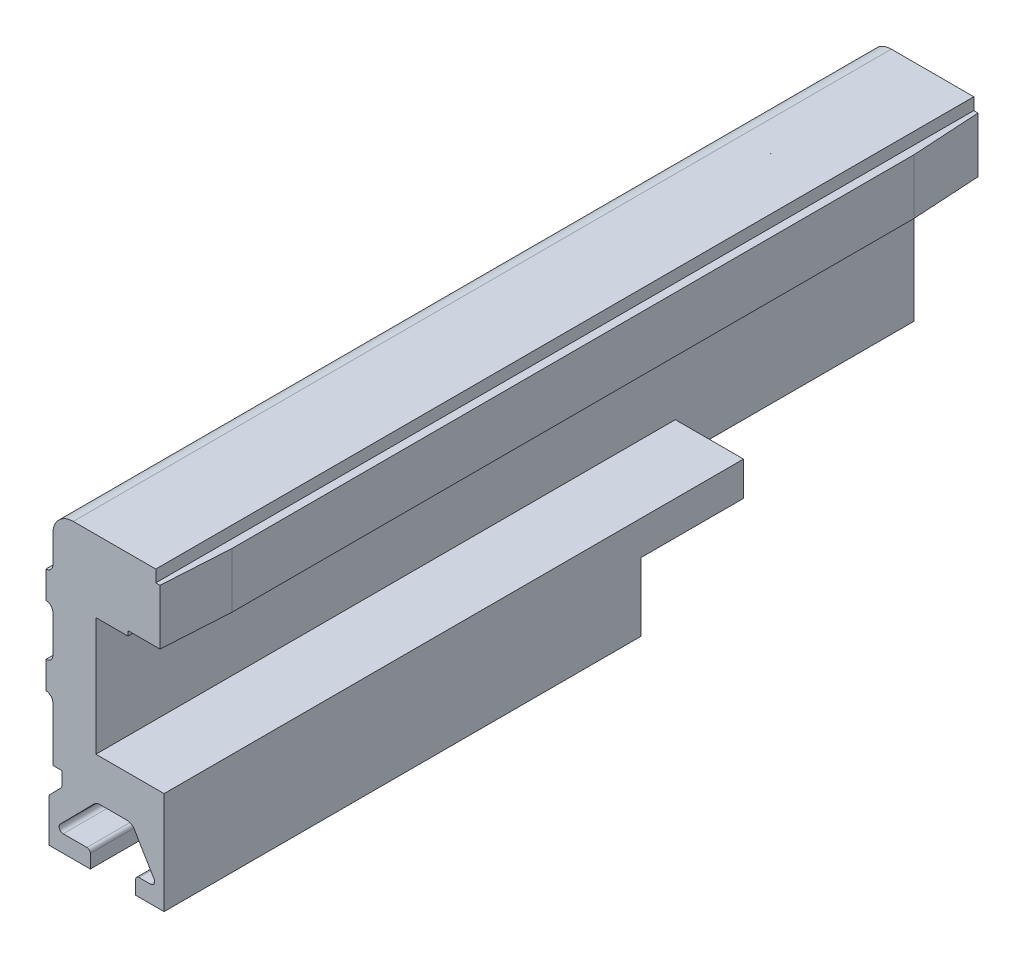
from build123d import *

# Parameters (mm, degrees)
EXTRUDE1_DEPTH     = 152.4
SKETCH2_W          = 63.5
SKETCH2_H          = 12.7
CUT_EXTRUDE1_DEPTH = 164.342499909
SKETCH3_W          = 44.45
SKETCH3_H          = 6.35
CUT_EXTRUDE2_DEPTH = 12.7
SKETCH4_R          = 2.413
CUT_EXTRUDE3_DEPTH = 163.352134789
CUT_EXTRUDE4_REACH = 164.539
SKETCH12_W         = 0.790251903
SKETCH12_H         = 0.684884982
SKETCH12_H_2       = 3.002957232
EXTRUDE3_DEPTH     = 0.127


with BuildPart() as part:
    # Sketch1 → Extrude1 (new body)
    with BuildSketch(Plane.XY):
        with BuildLine():
            Line((19.91614, 54.5084), (4.546619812, 54.5084))
            ThreePointArc((4.546619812, 54.5084), (1.852528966, 53.392471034), (0.7366, 50.698380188))
            Line((0.7366, 50.698380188), (0.7366, 45.567713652))
            ThreePointArc((0.7366, 45.567713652), (0.364632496, 44.669647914), (-0.5334, 44.297600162))
            Line((-0.5334, 44.297600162), (-0.5334, 39.217600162))
            ThreePointArc((-0.5334, 39.217600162), (0.358682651, 38.85157562), (0.7366, 37.964465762))
            Line((0.7366, 37.964465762), (0.7366, 30.988190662))
            ThreePointArc((0.7366, 30.988190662), (0.36459237, 30.090084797), (-0.533513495, 29.718077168))
            Line((-0.533513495, 29.718077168), (-0.533513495, 24.638077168))
            ThreePointArc((-0.533513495, 24.638077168), (0.36459237, 24.266069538), (0.7366, 23.367963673))
            Line((0.7366, 23.367963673), (0.7366, 13.235253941))
            Line((0.7366, 13.235253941), (2.413, 13.235253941))
            Line((2.413, 13.235253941), (2.413, 10.822253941))
            ThreePointArc((2.413, 10.822253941), (2.355993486, 10.533068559), (2.193503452, 10.287152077))
            Line((2.193503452, 10.287152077), (0.219496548, 8.28584049))
            ThreePointArc((0.219496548, 8.28584049), (0.057006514, 8.039924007), (0, 7.750738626))
            Line((0, 7.750738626), (0, 0))
            Line((0, 0), (7.7216, 0))
            Line((7.7216, 0), (7.7216, 2.54))
            ThreePointArc((7.7216, 2.54), (7.535612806, 2.989012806), (7.0866, 3.175))
            Line((7.0866, 3.175), (2.667, 3.175))
            ThreePointArc((2.667, 3.175), (1.964009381, 3.642979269), (2.124496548, 4.472101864))
            Line((2.124496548, 4.472101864), (8.414593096, 10.849203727))
            ThreePointArc((8.414593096, 10.849203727), (8.911558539, 11.184981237), (9.4996, 11.303))
            Line((9.4996, 11.303), (14.5796, 11.303))
            ThreePointArc((14.5796, 11.303), (15.332434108, 11.104072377), (15.88873344, 10.559221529))
            Line((15.88873344, 10.559221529), (19.60296672, 4.327110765))
            ThreePointArc((19.60296672, 4.327110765), (19.610936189, 3.560582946), (18.9484, 3.175))
            Line((18.9484, 3.175), (16.7894, 3.175))
            ThreePointArc((16.7894, 3.175), (16.340387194, 2.989012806), (16.1544, 2.54))
            Line((16.1544, 2.54), (16.1544, 0))
            Line((16.1544, 0), (21.463, 0))
            Line((21.463, 0), (21.463, 19.05))
            Line((21.463, 19.05), (8.763, 19.05))
            Line((8.763, 19.05), (8.763, 41.0972))
            Line((8.763, 41.0972), (14.732, 41.0972))
            Line((14.732, 41.0972), (14.732, 41.9862))
            Line((14.732, 41.9862), (21.463, 41.9862))
            Line((21.463, 41.9862), (21.463, 52.2732))
            Line((21.463, 52.2732), (19.91614, 52.2732))
            Line((19.91614, 52.2732), (19.91614, 54.5084))
        make_face()
    extrude(amount=EXTRUDE1_DEPTH)

    # Sketch2 → Cut-Extrude1 (cut, through all)
    with BuildSketch(Plane(origin=(21.463, 0, 0), x_dir=(0, 0, -1), z_dir=(1, 0, 0))):
        with Locations((-31.75, 6.35)):
            Rectangle(SKETCH2_W, SKETCH2_H)
    extrude(amount=-CUT_EXTRUDE1_DEPTH, mode=Mode.SUBTRACT)

    # Sketch3 → Cut-Extrude2 (cut)
    with BuildSketch(Plane(origin=(21.463, 0, 0), x_dir=(0, 0, -1), z_dir=(1, 0, 0))):
        with Locations((-22.225, 15.875)):
            Rectangle(SKETCH3_W, SKETCH3_H)
    extrude(amount=-CUT_EXTRUDE2_DEPTH, mode=Mode.SUBTRACT)

    # Sketch4 → Cut-Extrude3 (cut, through all)
    with BuildSketch(Plane(origin=(8.763, 0, 0), x_dir=(0, 0, -1), z_dir=(1, 0, 0))):
        with Locations((-12.7, 31.8008)):
            Circle(SKETCH4_R)
    extrude(amount=-CUT_EXTRUDE3_DEPTH, mode=Mode.SUBTRACT)

    # Sketch6 → Cut-Extrude4 (cut, up to next)
    with BuildSketch(Plane(origin=(0, 52.2732, 0), x_dir=(-1, 0, 0), z_dir=(0, 1, 0)), mode=Mode.PRIVATE) as cut_extrude4_sk1:
        Polygon((-21.463, 152.4), (-21.463, 139.7), (-20.701, 152.4), align=None)
    cut_extrude4_tool1 = extrude(cut_extrude4_sk1.sketch, amount=-CUT_EXTRUDE4_REACH, mode=Mode.PRIVATE) & part.part
    # Sketch6 → Cut-Extrude4 (cut, up to next)
    with BuildSketch(Plane(origin=(0, 52.2732, 0), x_dir=(-1, 0, 0), z_dir=(0, 1, 0)), mode=Mode.PRIVATE) as cut_extrude4_sk2:
        Polygon((-21.463, 0), (-21.463, 12.7), (-20.701, 0), align=None)
    cut_extrude4_tool2 = extrude(cut_extrude4_sk2.sketch, amount=-CUT_EXTRUDE4_REACH, mode=Mode.PRIVATE) & part.part
    add(cut_extrude4_tool1.solids().sort_by_distance((21.209, 52.2732, 148.166667))[0], mode=Mode.SUBTRACT)
    add(cut_extrude4_tool2.solids().sort_by_distance((21.209, 52.2732, 4.233333))[0], mode=Mode.SUBTRACT)

    # Sketch12 → Extrude3 (add)
    # profile 1 of 10: a face of its own
    with BuildSketch(Plane.ZY.offset(-0.7366)):
        with BuildLine():
            add(Edge.make_bspline(
                [(29.063970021, 33.066190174), (29.114779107, 33.031363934), (29.216594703, 32.961576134), (29.378541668, 32.871296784), (29.545636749, 32.789223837), (29.661763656, 32.745079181), (29.720043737, 32.722924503)],
                knots=[0, 0, 0, 0, 0.994855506, 1.99357661, 2.993045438, 4, 4, 4, 4], degree=3))
            Line((29.720043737, 32.722924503), (29.41793702, 32.143406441))
            add(Edge.make_bspline(
                [(29.41793702, 32.143406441), (29.356174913, 32.162524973), (29.231668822, 32.201065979), (29.114141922, 32.257418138), (29.054915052, 32.285816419)],
                knots=[0, 0, 0, 0, 0.992113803, 2, 2, 2, 2], degree=3))
            add(Edge.make_bspline(
                [(29.054915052, 32.285816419), (29.04910316, 32.288748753), (29.032272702, 32.297240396), (29.001702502, 32.318144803), (28.955059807, 32.346320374), (28.894343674, 32.385347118), (28.818943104, 32.433720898), (28.728614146, 32.491389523), (28.624602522, 32.559983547), (28.549801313, 32.60829556), (28.50997051, 32.634021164)],
                knots=[0, 0, 0, 0, 0.241377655, 0.698997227, 1.371388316, 2.263975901, 3.376788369, 4.695767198, 6.240533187, 8, 8, 8, 8], degree=3))
            add(Edge.make_bspline(
                [(28.50997051, 32.634021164), (28.476937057, 32.619874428), (28.410550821, 32.591444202), (28.307549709, 32.556436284), (28.20192934, 32.526945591), (28.094064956, 32.501935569), (27.983500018, 32.483352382), (27.87039083, 32.469101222), (27.754420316, 32.460743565), (27.676103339, 32.459921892), (27.636577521, 32.459507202)],
                knots=[0, 0, 0, 0, 0.961025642, 1.931341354, 2.907359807, 3.893838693, 4.891829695, 5.905170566, 6.942759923, 8, 8, 8, 8], degree=3))
            add(Edge.make_bspline(
                [(27.636577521, 32.459507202), (27.561602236, 32.461332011), (27.41504694, 32.464898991), (27.201350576, 32.490179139), (27.000556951, 32.533996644), (26.811784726, 32.593847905), (26.636168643, 32.672417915), (26.472168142, 32.76739109), (26.322053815, 32.881231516), (26.183757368, 33.010450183), (26.061404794, 33.156501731), (25.954293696, 33.316836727), (25.863556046, 33.490923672), (25.790390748, 33.679679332), (25.732566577, 33.881577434), (25.693142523, 34.09804325), (25.667768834, 34.327792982), (25.664892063, 34.485829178), (25.663417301, 34.56684561)],
                knots=[0, 0, 0, 0, 1.098101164, 2.146474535, 3.146072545, 4.104420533, 5.041773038, 5.958565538, 6.874115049, 7.795336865, 8.725215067, 9.658214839, 10.614563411, 11.594512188, 12.618591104, 13.685899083, 14.813688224, 16, 16, 16, 16], degree=3))
            add(Edge.make_bspline(
                [(25.663417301, 34.56684561), (25.664895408, 34.647858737), (25.667768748, 34.805342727), (25.692969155, 35.034649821), (25.733707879, 35.25034225), (25.790942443, 35.452561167), (25.865203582, 35.640775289), (25.956295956, 35.814879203), (26.06357545, 35.975552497), (26.187378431, 36.121282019), (26.324941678, 36.251823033), (26.475492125, 36.364817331), (26.637279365, 36.461292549), (26.810946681, 36.539788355), (26.99697349, 36.599606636), (27.193943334, 36.643284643), (27.402946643, 36.668873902), (27.545956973, 36.672384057), (27.619290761, 36.674184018)],
                knots=[0, 0, 0, 0, 1.193283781, 2.319662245, 3.393996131, 4.424093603, 5.411284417, 6.369670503, 7.313761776, 8.251713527, 9.181123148, 10.102053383, 11.01932051, 11.951118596, 12.903560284, 13.893239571, 14.919681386, 16, 16, 16, 16], degree=3))
            add(Edge.make_bspline(
                [(27.619290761, 36.674184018), (27.69209783, 36.67286055), (27.834101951, 36.670279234), (28.041163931, 36.642671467), (28.236819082, 36.600783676), (28.421300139, 36.540402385), (28.593661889, 36.461986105), (28.754801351, 36.366778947), (28.903778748, 36.253976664), (29.040636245, 36.124681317), (29.1630414, 35.979454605), (29.271475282, 35.820685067), (29.360501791, 35.646415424), (29.435501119, 35.459602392), (29.491409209, 35.258423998), (29.532680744, 35.044033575), (29.557531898, 34.815755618), (29.560481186, 34.658829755), (29.561993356, 34.578370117)],
                knots=[0, 0, 0, 0, 1.078752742, 2.104017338, 3.091035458, 4.041673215, 4.975566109, 5.892967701, 6.810684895, 7.740128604, 8.678185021, 9.621404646, 10.583875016, 11.573429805, 12.6009998, 13.674031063, 14.80742018, 16, 16, 16, 16], degree=3))
            add(Edge.make_bspline(
                [(29.561993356, 34.578370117), (29.560362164, 34.493501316), (29.557191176, 34.328518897), (29.52959421, 34.08892719), (29.484858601, 33.864544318), (29.438770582, 33.723539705), (29.416290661, 33.654763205)],
                knots=[0, 0, 0, 0, 1.083667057, 2.106616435, 3.076482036, 4, 4, 4, 4], degree=3))
            add(Edge.make_bspline(
                [(29.416290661, 33.654763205), (29.396139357, 33.604103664), (29.355145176, 33.501045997), (29.274114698, 33.352288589), (29.177704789, 33.205527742), (29.102419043, 33.113294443), (29.063970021, 33.066190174)],
                knots=[0, 0, 0, 0, 0.948216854, 1.928975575, 2.942311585, 4, 4, 4, 4], degree=3))
        make_face()
        with BuildLine():
            add(Edge.make_bspline(
                [(28.40460359, 33.489304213), (28.434315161, 33.521786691), (28.493809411, 33.586829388), (28.567379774, 33.698235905), (28.631612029, 33.817706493), (28.682112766, 33.948221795), (28.722728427, 34.087794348), (28.751074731, 34.237461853), (28.768679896, 34.396848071), (28.770702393, 34.506431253), (28.771741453, 34.562729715)],
                knots=[0, 0, 0, 0, 0.906820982, 1.815812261, 2.745108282, 3.70056618, 4.696560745, 5.740060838, 6.83895416, 8, 8, 8, 8], degree=3))
            add(Edge.make_bspline(
                [(28.771741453, 34.562729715), (28.770830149, 34.620655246), (28.769064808, 34.732866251), (28.754442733, 34.895812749), (28.728711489, 35.04727694), (28.695129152, 35.187890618), (28.6493738, 35.316515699), (28.594193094, 35.434121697), (28.529500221, 35.54099798), (28.453705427, 35.635381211), (28.370338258, 35.718357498), (28.281219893, 35.791658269), (28.185048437, 35.853015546), (28.082313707, 35.902373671), (27.97387542, 35.941211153), (27.859476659, 35.969406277), (27.738859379, 35.985905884), (27.656384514, 35.988153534), (27.614351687, 35.989299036)],
                knots=[0, 0, 0, 0, 1.335693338, 2.587451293, 3.768164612, 4.876224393, 5.916940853, 6.910477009, 7.867661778, 8.790666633, 9.694493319, 10.576027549, 11.446684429, 12.318352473, 13.199023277, 14.098364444, 15.030842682, 16, 16, 16, 16], degree=3))
            add(Edge.make_bspline(
                [(27.614351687, 35.989299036), (27.57203745, 35.988190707), (27.489274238, 35.986022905), (27.368538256, 35.969123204), (27.253878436, 35.942286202), (27.145575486, 35.90314192), (27.0426503, 35.85369016), (26.946119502, 35.792446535), (26.855996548, 35.720296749), (26.772209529, 35.637844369), (26.697375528, 35.543431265), (26.630854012, 35.438415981), (26.575861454, 35.321589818), (26.53170051, 35.193608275), (26.496408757, 35.05512905), (26.470994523, 34.905409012), (26.456353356, 34.744673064), (26.454581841, 34.633828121), (26.453669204, 34.576723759)],
                knots=[0, 0, 0, 0, 0.980107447, 1.917010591, 2.819119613, 3.703969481, 4.579773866, 5.459928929, 6.346604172, 7.250235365, 8.177620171, 9.131899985, 10.124404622, 11.161948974, 12.264485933, 13.431998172, 14.677033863, 16, 16, 16, 16], degree=3))
            add(Edge.make_bspline(
                [(26.453669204, 34.576723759), (26.45455938, 34.518793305), (26.456287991, 34.406299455), (26.471247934, 34.24319346), (26.49550075, 34.091227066), (26.530025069, 33.950463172), (26.57416582, 33.820740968), (26.628535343, 33.702241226), (26.692845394, 33.59511213), (26.767302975, 33.500325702), (26.849213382, 33.416936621), (26.93673814, 33.344239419), (27.029166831, 33.281964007), (27.126930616, 33.231365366), (27.230055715, 33.192507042), (27.338182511, 33.164462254), (27.451940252, 33.147746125), (27.529508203, 33.145525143), (27.569076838, 33.144392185)],
                knots=[0, 0, 0, 0, 1.356840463, 2.634818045, 3.833173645, 4.958776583, 6.025986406, 7.038359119, 8.007356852, 8.946032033, 9.855123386, 10.740685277, 11.607120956, 12.460971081, 13.313368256, 14.183325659, 15.073285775, 16, 16, 16, 16], degree=3))
            add(Edge.make_bspline(
                [(27.569076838, 33.144392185), (27.598751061, 33.144912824), (27.65720311, 33.145938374), (27.743559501, 33.157466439), (27.827679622, 33.174131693), (27.882011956, 33.191100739), (27.909049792, 33.199545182)],
                knots=[0, 0, 0, 0, 1.028828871, 2.026578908, 3.017950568, 4, 4, 4, 4], degree=3))
            add(Edge.make_bspline(
                [(27.909049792, 33.199545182), (27.867597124, 33.221204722), (27.785510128, 33.264096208), (27.658599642, 33.31874778), (27.531435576, 33.367987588), (27.444948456, 33.394590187), (27.401971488, 33.407809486)],
                knots=[0, 0, 0, 0, 1.021704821, 2.023239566, 3.017713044, 4, 4, 4, 4], degree=3))
            Line((27.401971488, 33.407809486), (27.631638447, 33.881960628))
            add(Edge.make_bspline(
                [(27.631638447, 33.881960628), (27.698801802, 33.858750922), (27.833776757, 33.812107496), (28.028754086, 33.71948968), (28.221014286, 33.614077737), (28.342946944, 33.531208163), (28.40460359, 33.489304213)],
                knots=[0, 0, 0, 0, 0.979271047, 1.967993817, 2.972492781, 4, 4, 4, 4], degree=3))
        make_face(mode=Mode.SUBTRACT)
    # profile 2 of 10: a face of its own
    with BuildSketch(Plane.ZY.offset(-0.7366)):
        with BuildLine():
            Line((32.090799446, 32.512190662), (32.090799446, 32.954237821))
            add(Edge.make_bspline(
                [(32.090799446, 32.954237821), (32.064635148, 32.916402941), (32.012715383, 32.841324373), (31.917301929, 32.742940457), (31.810454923, 32.657572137), (31.69291904, 32.586424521), (31.568303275, 32.529678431), (31.438694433, 32.48893492), (31.305589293, 32.4644596), (31.215585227, 32.461160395), (31.17048525, 32.459507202)],
                knots=[0, 0, 0, 0, 1.012300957, 2.008784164, 3.006972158, 4.019128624, 5.028517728, 6.017265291, 7.006475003, 8, 8, 8, 8], degree=3))
            add(Edge.make_bspline(
                [(31.17048525, 32.459507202), (31.124820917, 32.461018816), (31.035266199, 32.46398332), (30.904779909, 32.489397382), (30.781606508, 32.530935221), (30.666358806, 32.588052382), (30.56288907, 32.661158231), (30.472811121, 32.747717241), (30.400016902, 32.849075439), (30.351666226, 32.943320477), (30.321324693, 33.026180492), (30.301926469, 33.094821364), (30.284340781, 33.169164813), (30.270847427, 33.249215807), (30.259900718, 33.334884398), (30.253022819, 33.426111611), (30.247681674, 33.52326687), (30.247151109, 33.589998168), (30.246878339, 33.62430558)],
                knots=[0, 0, 0, 0, 1.289498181, 2.528902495, 3.740215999, 4.953909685, 6.150063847, 7.307074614, 8.467199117, 9.660131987, 10.288158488, 10.958106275, 11.674712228, 12.445953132, 13.25095176, 14.114470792, 15.030625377, 16, 16, 16, 16], degree=3))
            Line((30.246878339, 33.62430558), (30.246878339, 35.515147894))
            Line((30.246878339, 35.515147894), (31.037130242, 35.515147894))
            Line((31.037130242, 35.515147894), (31.037130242, 34.129737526))
            add(Edge.make_bspline(
                [(31.037130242, 34.129737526), (31.037361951, 34.079249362), (31.037801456, 33.983483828), (31.039080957, 33.847365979), (31.042591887, 33.726910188), (31.046342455, 33.621776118), (31.051903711, 33.531999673), (31.059114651, 33.457584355), (31.067164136, 33.398522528), (31.078169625, 33.340944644), (31.100765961, 33.283156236), (31.131890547, 33.221080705), (31.174438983, 33.167795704), (31.223659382, 33.121516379), (31.281015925, 33.083167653), (31.347176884, 33.058952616), (31.419224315, 33.040877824), (31.469993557, 33.039660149), (31.49646416, 33.039025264)],
                knots=[0, 0, 0, 0, 1.799930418, 3.414093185, 4.852592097, 6.095879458, 7.164323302, 8.058836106, 8.760219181, 9.289718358, 10.143846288, 10.96209893, 11.756558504, 12.559405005, 13.365225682, 14.195378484, 15.059087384, 16, 16, 16, 16], degree=3))
            add(Edge.make_bspline(
                [(31.49646416, 33.039025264), (31.527028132, 33.040548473), (31.587214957, 33.043547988), (31.675178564, 33.064451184), (31.757328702, 33.10075345), (31.833930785, 33.149042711), (31.900995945, 33.208829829), (31.959232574, 33.275235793), (32.004596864, 33.349031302), (32.033523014, 33.417808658), (32.050857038, 33.482948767), (32.060367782, 33.54760204), (32.070802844, 33.626544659), (32.0771835, 33.720855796), (32.084358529, 33.830012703), (32.087822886, 33.954383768), (32.090429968, 34.093779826), (32.090671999, 34.19174843), (32.090799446, 34.243336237)],
                knots=[0, 0, 0, 0, 0.960139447, 1.890714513, 2.821289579, 3.770841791, 4.723832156, 5.63466777, 6.536687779, 7.433335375, 7.968708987, 8.650470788, 9.484586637, 10.470508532, 11.619255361, 12.921832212, 14.379114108, 16, 16, 16, 16], degree=3))
            Line((32.090799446, 34.243336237), (32.090799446, 35.515147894))
            Line((32.090799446, 35.515147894), (32.881051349, 35.515147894))
            Line((32.881051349, 35.515147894), (32.881051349, 32.512190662))
            Line((32.881051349, 32.512190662), (32.090799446, 32.512190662))
        make_face()
    # profile 3 of 10: a face of its own
    with BuildSketch(Plane.ZY.offset(-0.7366)):
        with Locations((34.119112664, 36.279058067)):
            Rectangle(SKETCH12_W, SKETCH12_H)
    # profile 4 of 10: a face of its own
    with BuildSketch(Plane.ZY.offset(-0.7366)):
        with Locations((34.119112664, 34.013669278)):
            Rectangle(SKETCH12_W, SKETCH12_H_2)
    # profile 5 of 10: a face of its own
    with BuildSketch(Plane.ZY.offset(-0.7366)):
        with BuildLine():
            Line((37.780613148, 34.61952907), (36.990361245, 34.51416215))
            add(Edge.make_bspline(
                [(36.990361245, 34.51416215), (36.98309805, 34.551169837), (36.96924159, 34.621771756), (36.934108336, 34.719543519), (36.886057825, 34.802644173), (36.825966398, 34.870538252), (36.755234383, 34.9234458), (36.674894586, 34.962027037), (36.584086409, 34.984469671), (36.52045328, 34.986999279), (36.487398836, 34.988313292)],
                knots=[0, 0, 0, 0, 1.183520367, 2.2578771, 3.246797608, 4.180863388, 5.085846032, 6.003342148, 6.962829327, 8, 8, 8, 8], degree=3))
            add(Edge.make_bspline(
                [(36.487398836, 34.988313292), (36.464867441, 34.987694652), (36.420948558, 34.986488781), (36.356706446, 34.976660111), (36.296526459, 34.958841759), (36.238870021, 34.936163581), (36.185632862, 34.905273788), (36.135237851, 34.868762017), (36.089263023, 34.82461107), (36.046163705, 34.774148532), (36.006535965, 34.715952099), (35.974423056, 34.647844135), (35.946265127, 34.571565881), (35.923380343, 34.486124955), (35.905736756, 34.391702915), (35.892457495, 34.288385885), (35.88536163, 34.17621105), (35.884470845, 34.098466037), (35.88400858, 34.058120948)],
                knots=[0, 0, 0, 0, 0.862078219, 1.680389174, 2.478024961, 3.259954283, 4.04533088, 4.826625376, 5.636266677, 6.477958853, 7.363321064, 8.321359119, 9.351280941, 10.472100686, 11.701575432, 13.024867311, 14.456081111, 16, 16, 16, 16], degree=3))
            add(Edge.make_bspline(
                [(35.88400858, 34.058120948), (35.884363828, 34.013379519), (35.885048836, 33.927106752), (35.893581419, 33.802682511), (35.90629728, 33.688605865), (35.924215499, 33.584563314), (35.94775579, 33.490921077), (35.976621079, 33.407191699), (36.00964371, 33.333093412), (36.050163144, 33.270026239), (36.093581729, 33.214849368), (36.142472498, 33.168819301), (36.192954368, 33.127446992), (36.249061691, 33.095814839), (36.307454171, 33.069381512), (36.370415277, 33.052945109), (36.436130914, 33.040296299), (36.481570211, 33.039453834), (36.504685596, 33.039025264)],
                knots=[0, 0, 0, 0, 1.594318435, 3.074248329, 4.44256617, 5.683784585, 6.834147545, 7.879495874, 8.83778105, 9.716843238, 10.544636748, 11.333080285, 12.105903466, 12.864046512, 13.621684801, 14.38335177, 15.177596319, 16, 16, 16, 16], degree=3))
            add(Edge.make_bspline(
                [(36.504685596, 33.039025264), (36.538601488, 33.040483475), (36.604383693, 33.043311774), (36.697793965, 33.068652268), (36.781697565, 33.109688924), (36.842540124, 33.157936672), (36.886725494, 33.204401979), (36.915506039, 33.24720159), (36.944459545, 33.294029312), (36.968217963, 33.348216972), (36.991879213, 33.407176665), (37.010808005, 33.472776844), (37.02960927, 33.54335366), (37.038470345, 33.592943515), (37.043044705, 33.618543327)],
                knots=[0, 0, 0, 0, 1.391704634, 2.699306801, 3.945045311, 5.206156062, 5.868460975, 6.572467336, 7.320954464, 8.128297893, 8.999513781, 9.930638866, 10.931732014, 12, 12, 12, 12], degree=3))
            Line((37.043044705, 33.618543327), (37.833296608, 33.513176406))
            add(Edge.make_bspline(
                [(37.833296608, 33.513176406), (37.822893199, 33.471035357), (37.802504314, 33.388446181), (37.762876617, 33.269845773), (37.716620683, 33.158992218), (37.664273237, 33.055572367), (37.603878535, 32.960703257), (37.537112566, 32.873730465), (37.463242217, 32.795169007), (37.383217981, 32.72378779), (37.295791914, 32.661059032), (37.200829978, 32.607488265), (37.099719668, 32.561020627), (36.990794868, 32.524433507), (36.875409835, 32.494284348), (36.752469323, 32.474427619), (36.622671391, 32.461675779), (36.533803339, 32.460242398), (36.488222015, 32.459507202)],
                knots=[0, 0, 0, 0, 1.110268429, 2.175934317, 3.195555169, 4.181481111, 5.137790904, 6.068820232, 6.982751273, 7.892872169, 8.808581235, 9.729898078, 10.678730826, 11.651191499, 12.666063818, 13.726769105, 14.834036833, 16, 16, 16, 16], degree=3))
            add(Edge.make_bspline(
                [(36.488222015, 32.459507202), (36.43630119, 32.460766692), (36.335118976, 32.46322116), (36.187346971, 32.482505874), (36.047644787, 32.514207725), (35.915983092, 32.560073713), (35.791804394, 32.617263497), (35.676385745, 32.689089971), (35.569099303, 32.773368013), (35.470195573, 32.869854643), (35.38118718, 32.977499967), (35.304349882, 33.096232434), (35.239151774, 33.224569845), (35.185423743, 33.362642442), (35.144445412, 33.511108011), (35.115359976, 33.669213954), (35.096594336, 33.837058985), (35.094718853, 33.952153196), (35.093756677, 34.011199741)],
                knots=[0, 0, 0, 0, 1.056003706, 2.057917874, 3.026125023, 3.965316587, 4.889355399, 5.801804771, 6.724223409, 7.659808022, 8.607570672, 9.559810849, 10.530974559, 11.531347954, 12.568834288, 13.659317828, 14.799164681, 16, 16, 16, 16], degree=3))
            add(Edge.make_bspline(
                [(35.093756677, 34.011199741), (35.094721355, 34.07079479), (35.09660212, 34.186983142), (35.115314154, 34.356197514), (35.144368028, 34.515431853), (35.185696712, 34.66446951), (35.23792615, 34.803580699), (35.303614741, 34.931892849), (35.38033175, 35.050682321), (35.469414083, 35.158261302), (35.568022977, 35.254834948), (35.675952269, 35.338433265), (35.79164763, 35.40986695), (35.916182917, 35.467458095), (36.048737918, 35.513231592), (36.18983357, 35.544817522), (36.339240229, 35.564117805), (36.441515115, 35.566572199), (36.493984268, 35.567831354)],
                knots=[0, 0, 0, 0, 1.206261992, 2.351765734, 3.442553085, 4.480484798, 5.479315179, 6.445885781, 7.393622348, 8.336902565, 9.26806234, 10.182699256, 11.09556262, 12.0152312, 12.955233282, 13.92969179, 14.937888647, 16, 16, 16, 16], degree=3))
            add(Edge.make_bspline(
                [(36.493984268, 35.567831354), (36.536822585, 35.567394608), (36.620470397, 35.566541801), (36.742468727, 35.554218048), (36.857854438, 35.536833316), (36.966539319, 35.511031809), (37.068571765, 35.478472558), (37.163777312, 35.438169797), (37.251768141, 35.389822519), (37.333659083, 35.334801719), (37.408968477, 35.271360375), (37.479250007, 35.201400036), (37.543719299, 35.123206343), (37.603134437, 35.037840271), (37.655519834, 34.943928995), (37.703671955, 34.843244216), (37.745459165, 34.734341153), (37.768721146, 34.658368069), (37.780613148, 34.61952907)],
                knots=[0, 0, 0, 0, 1.178528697, 2.301242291, 3.371523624, 4.388184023, 5.372173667, 6.316227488, 7.228761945, 8.131556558, 9.02696084, 9.934795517, 10.857276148, 11.812560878, 12.793328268, 13.813516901, 14.882225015, 16, 16, 16, 16], degree=3))
        make_face()
    # profile 6 of 10: a face of its own
    with BuildSketch(Plane.ZY.offset(-0.7366)):
        Polygon((38.46549813, 32.512190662), (38.46549813, 36.621500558), (39.255750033, 36.621500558), (39.255750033, 34.457362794), (40.177710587, 35.515147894), (41.07332941, 35.515147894), (40.081398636, 34.401386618), (41.126012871, 32.512190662), (40.335760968, 32.512190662), (39.581728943, 33.839978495), (39.255750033, 33.473663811), (39.255750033, 32.512190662), align=None)
    # profile 7 of 10: a face of its own
    with BuildSketch(Plane.ZY.offset(-0.7366)):
        with BuildLine():
            Line((44.260678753, 32.512190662), (43.47042685, 32.512190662))
            Line((43.47042685, 32.512190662), (43.47042685, 32.94600603))
            add(Edge.make_bspline(
                [(43.47042685, 32.94600603), (43.441581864, 32.905613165), (43.385517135, 32.827103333), (43.28551152, 32.726493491), (43.180493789, 32.639845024), (43.066035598, 32.574089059), (42.949092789, 32.522816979), (42.830639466, 32.48626554), (42.711194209, 32.464027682), (42.631149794, 32.46101041), (42.591271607, 32.459507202)],
                knots=[0, 0, 0, 0, 1.136300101, 2.208576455, 3.242281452, 4.249058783, 5.223933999, 6.165280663, 7.085941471, 8, 8, 8, 8], degree=3))
            add(Edge.make_bspline(
                [(42.591271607, 32.459507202), (42.551691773, 32.460835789), (42.473446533, 32.463462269), (42.357998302, 32.482520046), (42.247194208, 32.516037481), (42.140500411, 32.561359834), (42.038308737, 32.619642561), (41.940724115, 32.691045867), (41.847552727, 32.775741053), (41.758891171, 32.872161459), (41.678512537, 32.9809484), (41.607221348, 33.099719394), (41.547899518, 33.22934528), (41.499505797, 33.36889141), (41.46172041, 33.518736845), (41.434692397, 33.678634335), (41.41932332, 33.84873216), (41.416976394, 33.965345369), (41.415771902, 34.025193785)],
                knots=[0, 0, 0, 0, 0.868680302, 1.717291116, 2.559594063, 3.404262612, 4.256691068, 5.136162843, 6.05305749, 7.01654586, 8.006773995, 9.017023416, 10.051895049, 11.130067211, 12.254925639, 13.440213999, 14.686262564, 16, 16, 16, 16], degree=3))
            add(Edge.make_bspline(
                [(41.415771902, 34.025193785), (41.416969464, 34.086413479), (41.419293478, 34.205217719), (41.434581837, 34.377794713), (41.461640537, 34.53879985), (41.49940422, 34.688660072), (41.547710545, 34.827465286), (41.607061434, 34.955024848), (41.677153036, 35.071220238), (41.758298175, 35.174964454), (41.847135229, 35.267407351), (41.942874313, 35.347414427), (42.044153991, 35.415499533), (42.150586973, 35.472135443), (42.263529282, 35.515074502), (42.38179059, 35.545040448), (42.505522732, 35.565200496), (42.590091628, 35.56694235), (42.63325374, 35.567831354)],
                knots=[0, 0, 0, 0, 1.327136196, 2.575468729, 3.751890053, 4.862767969, 5.921925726, 6.933145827, 7.907387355, 8.856890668, 9.782390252, 10.681851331, 11.556239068, 12.423659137, 13.289752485, 14.16837887, 15.06518071, 16, 16, 16, 16], degree=3))
            add(Edge.make_bspline(
                [(42.63325374, 35.567831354), (42.673118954, 35.566548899), (42.751660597, 35.564022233), (42.867418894, 35.544406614), (42.97893996, 35.512605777), (43.085967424, 35.466304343), (43.189527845, 35.408652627), (43.288292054, 35.337292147), (43.383207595, 35.253470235), (43.440845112, 35.189762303), (43.47042685, 35.157065)],
                knots=[0, 0, 0, 0, 0.992399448, 1.955205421, 2.915485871, 3.87381908, 4.85285833, 5.861755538, 6.90257267, 8, 8, 8, 8], degree=3))
            Line((43.47042685, 35.157065), (43.47042685, 36.621500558))
            Line((43.47042685, 36.621500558), (44.260678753, 36.621500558))
            Line((44.260678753, 36.621500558), (44.260678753, 32.512190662))
        make_face()
        with BuildLine():
            add(Edge.make_bspline(
                [(42.206023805, 34.070468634), (42.206141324, 34.03066742), (42.20636763, 33.954022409), (42.213633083, 33.843413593), (42.222750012, 33.74140585), (42.237146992, 33.648100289), (42.253558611, 33.562801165), (42.276139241, 33.486546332), (42.300896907, 33.417997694), (42.322467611, 33.377149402), (42.332793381, 33.357595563)],
                knots=[0, 0, 0, 0, 1.306099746, 2.515150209, 3.637201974, 4.666415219, 5.613193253, 6.485405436, 7.274972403, 8, 8, 8, 8], degree=3))
            add(Edge.make_bspline(
                [(42.332793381, 33.357595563), (42.348053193, 33.332167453), (42.377580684, 33.28296447), (42.431454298, 33.218618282), (42.487821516, 33.162336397), (42.550783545, 33.117669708), (42.617440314, 33.081630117), (42.689242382, 33.057095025), (42.765122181, 33.041643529), (42.817294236, 33.039911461), (42.843987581, 33.039025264)],
                knots=[0, 0, 0, 0, 1.120960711, 2.169040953, 3.168100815, 4.128109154, 5.080726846, 6.026866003, 6.990464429, 8, 8, 8, 8], degree=3))
            add(Edge.make_bspline(
                [(42.843987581, 33.039025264), (42.865424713, 33.039952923), (42.907738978, 33.041784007), (42.969924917, 33.052206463), (43.029211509, 33.071788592), (43.085945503, 33.098306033), (43.141098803, 33.131323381), (43.192905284, 33.173039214), (43.242423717, 33.221942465), (43.289397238, 33.27788259), (43.332372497, 33.341332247), (43.369425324, 33.412661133), (43.400570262, 33.491681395), (43.426796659, 33.577487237), (43.446538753, 33.67089672), (43.459888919, 33.771355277), (43.469609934, 33.879303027), (43.470148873, 33.953827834), (43.47042685, 33.992266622)],
                knots=[0, 0, 0, 0, 0.808519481, 1.595918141, 2.367946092, 3.154732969, 3.953063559, 4.785064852, 5.655532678, 6.573390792, 7.534530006, 8.538576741, 9.596996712, 10.732480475, 11.917354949, 13.191565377, 14.551451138, 16, 16, 16, 16], degree=3))
            add(Edge.make_bspline(
                [(43.47042685, 33.992266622), (43.470051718, 34.034812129), (43.469327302, 34.116971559), (43.461021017, 34.235691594), (43.447389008, 34.345436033), (43.427675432, 34.445786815), (43.403343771, 34.537108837), (43.372918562, 34.619057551), (43.337094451, 34.692045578), (43.294581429, 34.755169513), (43.247838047, 34.809449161), (43.19976047, 34.858013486), (43.146959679, 34.89766793), (43.091740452, 34.931035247), (43.032782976, 34.956811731), (42.970452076, 34.974575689), (42.905388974, 34.986928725), (42.860784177, 34.987848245), (42.838225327, 34.988313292)],
                knots=[0, 0, 0, 0, 1.538844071, 2.971654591, 4.302575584, 5.536777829, 6.668535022, 7.717613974, 8.694219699, 9.60272161, 10.461894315, 11.283130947, 12.06930595, 12.843865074, 13.612870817, 14.388700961, 15.185086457, 16, 16, 16, 16], degree=3))
            add(Edge.make_bspline(
                [(42.838225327, 34.988313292), (42.816229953, 34.98775479), (42.772791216, 34.986651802), (42.709178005, 34.975669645), (42.648333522, 34.957467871), (42.590531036, 34.931541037), (42.534849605, 34.899288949), (42.481976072, 34.859611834), (42.432388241, 34.812022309), (42.385729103, 34.757816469), (42.342231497, 34.697050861), (42.306642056, 34.627828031), (42.274891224, 34.552607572), (42.249657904, 34.469813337), (42.230026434, 34.380048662), (42.216529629, 34.283162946), (42.206840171, 34.179323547), (42.206301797, 34.107536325), (42.206023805, 34.070468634)],
                knots=[0, 0, 0, 0, 0.844531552, 1.667868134, 2.47173451, 3.278912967, 4.096287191, 4.939765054, 5.812329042, 6.731790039, 7.685377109, 8.6758465, 9.71559549, 10.819442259, 11.996209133, 13.242749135, 14.576279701, 16, 16, 16, 16], degree=3))
        make_face(mode=Mode.SUBTRACT)
    # profile 8 of 10: a face of its own
    with BuildSketch(Plane.ZY.offset(-0.7366)):
        with BuildLine():
            Line((45.893866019, 32.512190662), (45.103614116, 32.512190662))
            Line((45.103614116, 32.512190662), (45.103614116, 35.515147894))
            Line((45.103614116, 35.515147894), (45.893866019, 35.515147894))
            Line((45.893866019, 35.515147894), (45.893866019, 35.096149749))
            add(Edge.make_bspline(
                [(45.893866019, 35.096149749), (45.907520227, 35.11978514), (45.933862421, 35.165383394), (45.972829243, 35.230410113), (46.011607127, 35.288362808), (46.049836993, 35.339242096), (46.085283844, 35.384956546), (46.121346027, 35.422926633), (46.155226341, 35.455550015), (46.200557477, 35.488163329), (46.258735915, 35.519993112), (46.331858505, 35.548604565), (46.410170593, 35.56424224), (46.463441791, 35.566617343), (46.490670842, 35.567831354)],
                knots=[0, 0, 0, 0, 1.218987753, 2.351715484, 3.384890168, 4.330893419, 5.1939795, 5.965577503, 6.66790098, 7.29043559, 8.453252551, 9.620708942, 10.783848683, 12, 12, 12, 12], degree=3))
            add(Edge.make_bspline(
                [(46.490670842, 35.567831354), (46.530093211, 35.565618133), (46.609272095, 35.561172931), (46.726568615, 35.52942158), (46.840617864, 35.475673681), (46.911148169, 35.426775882), (46.947535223, 35.401549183)],
                knots=[0, 0, 0, 0, 0.956058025, 1.920219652, 2.927027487, 4, 4, 4, 4], degree=3))
            Line((46.947535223, 35.401549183), (46.763143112, 34.649986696))
            add(Edge.make_bspline(
                [(46.763143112, 34.649986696), (46.732062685, 34.669534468), (46.672848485, 34.706776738), (46.580422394, 34.746341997), (46.491524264, 34.772245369), (46.432657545, 34.775842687), (46.40423704, 34.777579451)],
                knots=[0, 0, 0, 0, 1.139741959, 2.17142794, 3.117176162, 4, 4, 4, 4], degree=3))
            add(Edge.make_bspline(
                [(46.40423704, 34.777579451), (46.378623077, 34.77648527), (46.328759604, 34.774355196), (46.256978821, 34.757391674), (46.190801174, 34.730060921), (46.129963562, 34.69077239), (46.075556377, 34.635821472), (46.028716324, 34.563430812), (45.989514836, 34.472932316), (45.959552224, 34.385089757), (45.940869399, 34.299710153), (45.927693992, 34.218411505), (45.917683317, 34.121085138), (45.908519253, 34.008026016), (45.902376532, 33.878984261), (45.897540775, 33.734366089), (45.894048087, 33.573833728), (45.893928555, 33.461592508), (45.893866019, 33.402870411)],
                knots=[0, 0, 0, 0, 0.752818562, 1.4655346, 2.15662141, 2.850671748, 3.581264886, 4.414089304, 5.371394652, 6.476667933, 7.138571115, 7.940099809, 8.898357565, 10.015825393, 11.276710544, 12.698206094, 14.272575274, 16, 16, 16, 16], degree=3))
            Line((45.893866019, 33.402870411), (45.893866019, 32.512190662))
        make_face()
    # profile 9 of 10: a face of its own
    with BuildSketch(Plane.ZY.offset(-0.7366)):
        with BuildLine():
            Line((47.843154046, 34.61952907), (47.158269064, 34.724895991))
            add(Edge.make_bspline(
                [(47.158269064, 34.724895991), (47.168533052, 34.759609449), (47.188624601, 34.827560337), (47.225492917, 34.924934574), (47.26866534, 35.014956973), (47.316278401, 35.098702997), (47.369799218, 35.17525714), (47.428372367, 35.244818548), (47.492328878, 35.307149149), (47.561974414, 35.36273149), (47.638648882, 35.412107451), (47.724092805, 35.45396844), (47.818178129, 35.489215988), (47.920772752, 35.517542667), (48.031704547, 35.541224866), (48.151822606, 35.55572275), (48.280352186, 35.566187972), (48.36886717, 35.56727281), (48.414440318, 35.567831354)],
                knots=[0, 0, 0, 0, 1.047140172, 2.049755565, 3.008539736, 3.933190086, 4.833981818, 5.707167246, 6.560530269, 7.413560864, 8.281243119, 9.193714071, 10.161006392, 11.183910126, 12.270717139, 13.439589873, 14.681737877, 16, 16, 16, 16], degree=3))
            add(Edge.make_bspline(
                [(48.414440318, 35.567831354), (48.455881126, 35.567601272), (48.536062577, 35.5671561), (48.652221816, 35.561319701), (48.760199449, 35.551749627), (48.8598542, 35.537603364), (48.951514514, 35.520781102), (49.034887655, 35.499448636), (49.110221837, 35.47427395), (49.197265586, 35.435140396), (49.292878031, 35.380147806), (49.392670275, 35.305477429), (49.472733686, 35.220536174), (49.525720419, 35.141259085), (49.557012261, 35.069403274), (49.579092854, 35.006094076), (49.59495791, 34.932123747), (49.610572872, 34.848551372), (49.620155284, 34.754924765), (49.628803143, 34.651220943), (49.633486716, 34.537527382), (49.634082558, 34.458189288), (49.634391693, 34.41702702)],
                knots=[0, 0, 0, 0, 1.253259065, 2.424859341, 3.516580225, 4.530621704, 5.468151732, 6.333678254, 7.13150538, 7.867126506, 9.216626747, 10.459871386, 11.622324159, 12.731817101, 13.322505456, 13.989117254, 14.756090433, 15.607496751, 16.559714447, 17.600403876, 18.755039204, 20, 20, 20, 20], degree=3))
            Line((49.634391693, 34.41702702), (49.634391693, 33.494243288))
            add(Edge.make_bspline(
                [(49.634391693, 33.494243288), (49.634647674, 33.462414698), (49.635142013, 33.400948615), (49.636155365, 33.311994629), (49.640743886, 33.229696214), (49.64556474, 33.153951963), (49.651118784, 33.084466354), (49.658326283, 33.021560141), (49.667345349, 32.964960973), (49.681815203, 32.897364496), (49.705090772, 32.815351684), (49.743146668, 32.717046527), (49.788797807, 32.614652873), (49.825958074, 32.547056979), (49.845125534, 32.512190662)],
                knots=[0, 0, 0, 0, 1.124218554, 2.171045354, 3.141373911, 4.034856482, 4.851737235, 5.603038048, 6.270604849, 6.87504238, 8.043824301, 9.276776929, 10.59534724, 12, 12, 12, 12], degree=3))
            Line((49.845125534, 32.512190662), (49.054873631, 32.512190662))
            add(Edge.make_bspline(
                [(49.054873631, 32.512190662), (49.049233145, 32.528056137), (49.036873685, 32.562820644), (49.020182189, 32.621095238), (49.000178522, 32.688992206), (48.986989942, 32.737984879), (48.979964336, 32.764083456)],
                knots=[0, 0, 0, 0, 0.768508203, 1.683958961, 2.766236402, 4, 4, 4, 4], degree=3))
            add(Edge.make_bspline(
                [(48.979964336, 32.764083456), (48.976935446, 32.775605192), (48.971452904, 32.796460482), (48.964146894, 32.82482584), (48.957812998, 32.846512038), (48.953651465, 32.858758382), (48.951976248, 32.863688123)],
                knots=[0, 0, 0, 0, 1.381357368, 2.500370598, 3.396327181, 4, 4, 4, 4], degree=3))
            add(Edge.make_bspline(
                [(48.951976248, 32.863688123), (48.918545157, 32.831456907), (48.853126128, 32.768385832), (48.746433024, 32.686702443), (48.637430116, 32.61638332), (48.524346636, 32.558994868), (48.408032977, 32.514143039), (48.287337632, 32.482866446), (48.162905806, 32.463405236), (48.078379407, 32.460813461), (48.035777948, 32.459507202)],
                knots=[0, 0, 0, 0, 1.082260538, 2.117802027, 3.127898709, 4.103827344, 5.070056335, 6.029309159, 7.006768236, 8, 8, 8, 8], degree=3))
            add(Edge.make_bspline(
                [(48.035777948, 32.459507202), (47.998711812, 32.46036516), (47.926316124, 32.462040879), (47.820675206, 32.473110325), (47.721374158, 32.494104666), (47.627958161, 32.522026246), (47.540200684, 32.557129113), (47.458859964, 32.601232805), (47.383458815, 32.653348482), (47.314745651, 32.713285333), (47.253160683, 32.779069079), (47.199112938, 32.849062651), (47.154401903, 32.924204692), (47.117412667, 33.003046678), (47.088146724, 33.08627885), (47.067959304, 33.173522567), (47.055091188, 33.265017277), (47.053642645, 33.327367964), (47.052902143, 33.359241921)],
                knots=[0, 0, 0, 0, 1.186431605, 2.317277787, 3.39378889, 4.430144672, 5.434756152, 6.413230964, 7.385260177, 8.362630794, 9.325691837, 10.265445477, 11.187216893, 12.118354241, 13.048828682, 14.005299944, 14.980300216, 16, 16, 16, 16], degree=3))
            add(Edge.make_bspline(
                [(47.052902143, 33.359241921), (47.054247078, 33.401057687), (47.056886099, 33.483108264), (47.079942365, 33.602311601), (47.116047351, 33.714910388), (47.167363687, 33.819492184), (47.231216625, 33.915120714), (47.308032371, 33.999529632), (47.396703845, 34.071400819), (47.499167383, 34.132435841), (47.619340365, 34.183850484), (47.759686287, 34.233380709), (47.923622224, 34.277771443), (48.041138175, 34.303169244), (48.103278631, 34.316599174)],
                knots=[0, 0, 0, 0, 0.9565892, 1.877012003, 2.769038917, 3.656897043, 4.535078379, 5.39337207, 6.259743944, 7.138913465, 8.11486349, 9.247429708, 10.544487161, 12, 12, 12, 12], degree=3))
            add(Edge.make_bspline(
                [(48.103278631, 34.316599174), (48.146097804, 34.32531224), (48.228523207, 34.342084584), (48.346923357, 34.36730244), (48.45509119, 34.392720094), (48.552567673, 34.418541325), (48.640383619, 34.442001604), (48.717622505, 34.465642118), (48.784589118, 34.489435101), (48.825267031, 34.50632567), (48.84413979, 34.51416215)],
                knots=[0, 0, 0, 0, 1.365613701, 2.628758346, 3.783158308, 4.837685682, 5.780080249, 6.623655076, 7.36143661, 8, 8, 8, 8], degree=3))
            Line((48.84413979, 34.51416215), (48.84413979, 34.589071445))
            add(Edge.make_bspline(
                [(48.84413979, 34.589071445), (48.843086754, 34.622654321), (48.841131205, 34.68501963), (48.821689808, 34.771498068), (48.787941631, 34.842726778), (48.747205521, 34.89020027), (48.706901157, 34.918838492), (48.671312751, 34.937898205), (48.629609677, 34.953109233), (48.582377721, 34.966591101), (48.528805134, 34.975803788), (48.469510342, 34.983453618), (48.404334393, 34.987207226), (48.359016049, 34.987934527), (48.335415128, 34.988313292)],
                knots=[0, 0, 0, 0, 1.600506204, 2.972230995, 4.195852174, 5.327580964, 5.908906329, 6.547275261, 7.247479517, 8.022494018, 8.887774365, 9.837646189, 10.873887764, 12, 12, 12, 12], degree=3))
            add(Edge.make_bspline(
                [(48.335415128, 34.988313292), (48.304054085, 34.98756392), (48.244459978, 34.98613992), (48.160477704, 34.970207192), (48.086580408, 34.945231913), (48.022527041, 34.907944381), (47.967308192, 34.857289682), (47.919225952, 34.791968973), (47.876630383, 34.711697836), (47.854732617, 34.651407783), (47.843154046, 34.61952907)],
                knots=[0, 0, 0, 0, 1.120680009, 2.129582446, 3.045508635, 3.899130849, 4.760899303, 5.707254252, 6.787697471, 8, 8, 8, 8], degree=3))
        make_face()
        with BuildLine():
            add(Edge.make_bspline(
                [(48.84413979, 33.934644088), (48.817017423, 33.92626845), (48.755930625, 33.907404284), (48.653322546, 33.879688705), (48.529643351, 33.850482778), (48.415590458, 33.825211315), (48.320380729, 33.80468594), (48.253216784, 33.787903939), (48.192693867, 33.771901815), (48.138721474, 33.75509709), (48.091227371, 33.739278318), (48.050902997, 33.722328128), (48.016344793, 33.70748577), (47.996961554, 33.695060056), (47.988033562, 33.689336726)],
                knots=[0, 0, 0, 0, 1.144223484, 2.577096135, 4.283377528, 6.266557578, 7.286341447, 8.209198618, 9.057088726, 9.80932547, 10.487940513, 11.073343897, 11.57317876, 12, 12, 12, 12], degree=3))
            add(Edge.make_bspline(
                [(47.988033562, 33.689336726), (47.965931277, 33.671928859), (47.923514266, 33.638521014), (47.877274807, 33.573961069), (47.847932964, 33.502386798), (47.844766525, 33.45172067), (47.843154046, 33.425919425)],
                knots=[0, 0, 0, 0, 1.075028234, 2.063111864, 3.013658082, 4, 4, 4, 4], degree=3))
            add(Edge.make_bspline(
                [(47.843154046, 33.425919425), (47.844576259, 33.400247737), (47.847366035, 33.34989078), (47.869586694, 33.277328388), (47.906952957, 33.210850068), (47.957845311, 33.151751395), (48.019084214, 33.100587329), (48.0912708, 33.065519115), (48.170798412, 33.042875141), (48.226590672, 33.040341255), (48.255566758, 33.039025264)],
                knots=[0, 0, 0, 0, 0.976809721, 1.916086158, 2.861451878, 3.862738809, 4.873423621, 5.878632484, 6.898253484, 8, 8, 8, 8], degree=3))
            add(Edge.make_bspline(
                [(48.255566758, 33.039025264), (48.288676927, 33.040523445), (48.355333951, 33.043539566), (48.453095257, 33.071097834), (48.549616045, 33.111773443), (48.608222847, 33.15180515), (48.638345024, 33.172380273)],
                knots=[0, 0, 0, 0, 0.962503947, 1.937702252, 2.940039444, 4, 4, 4, 4], degree=3))
            add(Edge.make_bspline(
                [(48.638345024, 33.172380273), (48.659618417, 33.189506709), (48.700981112, 33.22280631), (48.750279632, 33.283658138), (48.79096184, 33.348389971), (48.807175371, 33.39614369), (48.815328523, 33.420157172)],
                knots=[0, 0, 0, 0, 1.055399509, 2.052054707, 3.020454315, 4, 4, 4, 4], degree=3))
            add(Edge.make_bspline(
                [(48.815328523, 33.420157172), (48.819822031, 33.43984985), (48.830340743, 33.485947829), (48.837761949, 33.567101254), (48.843765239, 33.669207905), (48.844007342, 33.744473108), (48.84413979, 33.785648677)],
                knots=[0, 0, 0, 0, 0.659054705, 1.542760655, 2.655710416, 4, 4, 4, 4], degree=3))
            Line((48.84413979, 33.785648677), (48.84413979, 33.934644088))
        make_face(mode=Mode.SUBTRACT)
    # profile 10 of 10: a face of its own
    with BuildSketch(Plane.ZY.offset(-0.7366)):
        Polygon((51.012393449, 32.512190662), (50.055859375, 35.515147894), (50.832940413, 35.515147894), (51.39928761, 33.546926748), (51.916244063, 35.515147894), (52.68591649, 35.515147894), (53.190525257, 33.546926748), (53.758518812, 35.515147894), (54.533953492, 35.515147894), (53.579888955, 32.512190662), (52.816801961, 32.512190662), (52.294906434, 34.44336875), (51.786181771, 32.512190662), align=None)
    extrude(amount=EXTRUDE3_DEPTH)


solid = part.part
